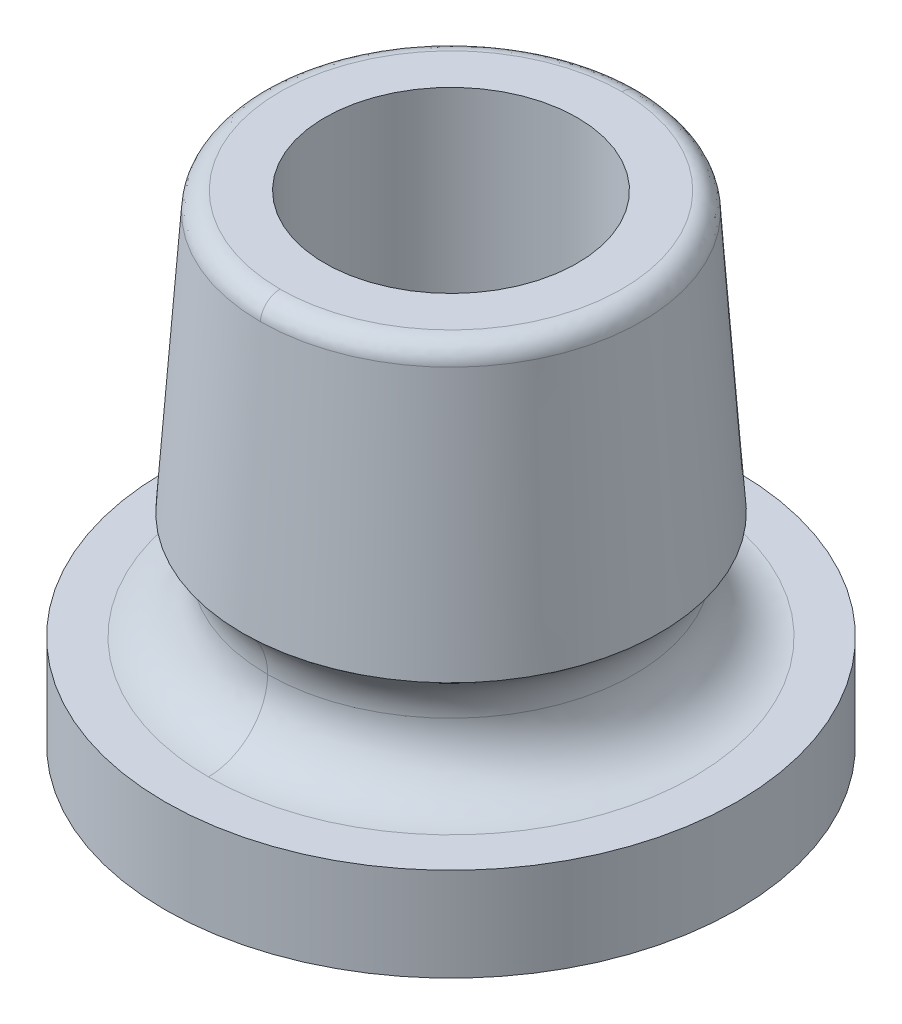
ISO-10303-21;
HEADER;
FILE_DESCRIPTION(('STEP AP214'),'2;1');
FILE_NAME('part.step','',(''),(''),'','','');
FILE_SCHEMA(('AUTOMOTIVE_DESIGN { 1 0 10303 214 1 1 1 1 }'));
ENDSEC;
DATA;
#1=APPLICATION_CONTEXT('core data for automotive mechanical design processes');
#2=APPLICATION_PROTOCOL_DEFINITION('international standard','automotive_design',2000,#1);
#3=PRODUCT_CONTEXT('',#1,'mechanical');
#4=PRODUCT('Part','Part','',(#3));
#5=PRODUCT_RELATED_PRODUCT_CATEGORY('part','',(#4));
#6=PRODUCT_DEFINITION_FORMATION('','',#4);
#7=PRODUCT_DEFINITION_CONTEXT('part definition',#1,'design');
#8=PRODUCT_DEFINITION('design','',#6,#7);
#9=PRODUCT_DEFINITION_SHAPE('','',#8);
#10=(LENGTH_UNIT() NAMED_UNIT(*) SI_UNIT(.MILLI.,.METRE.));
#11=(NAMED_UNIT(*) PLANE_ANGLE_UNIT() SI_UNIT($,.RADIAN.));
#12=(NAMED_UNIT(*) SI_UNIT($,.STERADIAN.) SOLID_ANGLE_UNIT());
#13=UNCERTAINTY_MEASURE_WITH_UNIT(LENGTH_MEASURE(1.E-05),#10,'distance_accuracy_value','');
#14=(GEOMETRIC_REPRESENTATION_CONTEXT(3) GLOBAL_UNCERTAINTY_ASSIGNED_CONTEXT((#13)) GLOBAL_UNIT_ASSIGNED_CONTEXT((#10,
#11,#12)) REPRESENTATION_CONTEXT('',''));
#15=CARTESIAN_POINT('',(0.,0.,0.));
#16=DIRECTION('',(0.,0.,1.));
#17=DIRECTION('',(1.,0.,0.));
#18=AXIS2_PLACEMENT_3D('',#15,#16,#17);
#19=CARTESIAN_POINT('',(0.,5.5873655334,-1.0880917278));
#20=CARTESIAN_POINT('',(-2.176183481,5.5873655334,-1.0880917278));
#21=CARTESIAN_POINT('',(-2.176183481,5.5873655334,1.0880917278));
#22=CARTESIAN_POINT('',(0.,5.5873655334,1.0880917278));
#23=CARTESIAN_POINT('',(0.,5.5955833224,-1.1699956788));
#24=CARTESIAN_POINT('',(-2.3399913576,5.5955833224,-1.1699956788));
#25=CARTESIAN_POINT('',(-2.3399913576,5.5955833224,1.1699956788));
#26=CARTESIAN_POINT('',(0.,5.5955833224,1.1699956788));
#27=CARTESIAN_POINT('',(0.,5.5394445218,-1.230197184));
#28=CARTESIAN_POINT('',(-2.460394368,5.5394445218,-1.230197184));
#29=CARTESIAN_POINT('',(-2.460394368,5.5394445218,1.230197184));
#30=CARTESIAN_POINT('',(0.,5.5394445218,1.230197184));
#31=CARTESIAN_POINT('',(0.,5.4571668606,-1.2277127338));
#32=CARTESIAN_POINT('',(-2.4554254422,5.4571668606,-1.2277127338));
#33=CARTESIAN_POINT('',(-2.4554254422,5.4571668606,1.2277127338));
#34=CARTESIAN_POINT('',(0.,5.4571668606,1.2277127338));
#35=(BOUNDED_SURFACE() B_SPLINE_SURFACE(3,3,((#19,#20,#21,#22),(#23,#24,#25,#26),(#27,#28,#29,
#30),(#31,#32,#33,#34)),.UNSPECIFIED.,.F.,.F.,.F.) B_SPLINE_SURFACE_WITH_KNOTS((4,4),(4,4),(0.,
1.),(0.,1.),.UNSPECIFIED.) GEOMETRIC_REPRESENTATION_ITEM() RATIONAL_B_SPLINE_SURFACE(((1.,
0.333333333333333,0.333333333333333,1.),(0.773075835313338,0.257691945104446,0.257691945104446,
0.773075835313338),(0.773075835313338,0.257691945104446,0.257691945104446,0.773075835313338),
(1.,0.333333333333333,0.333333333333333,1.))) REPRESENTATION_ITEM('') SURFACE());
#36=CARTESIAN_POINT('',(0.,5.5873655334,1.0880917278));
#37=CARTESIAN_POINT('',(0.,5.5955833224,1.1699956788));
#38=CARTESIAN_POINT('',(0.,5.5394445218,1.230197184));
#39=CARTESIAN_POINT('',(0.,5.4571668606,1.2277127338));
#40=(BOUNDED_CURVE() B_SPLINE_CURVE(3,(#36,#37,#38,#39),.UNSPECIFIED.,.F.,
.F.) B_SPLINE_CURVE_WITH_KNOTS((4,4),(0.,1.),
.UNSPECIFIED.) CURVE() GEOMETRIC_REPRESENTATION_ITEM() RATIONAL_B_SPLINE_CURVE((1.,
0.773075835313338,0.773075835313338,1.)) REPRESENTATION_ITEM(''));
#41=CARTESIAN_POINT('',(-2.51756514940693E-10,5.46985906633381,1.22746122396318));
#42=VERTEX_POINT('',#41);
#43=CARTESIAN_POINT('',(0.,5.58800000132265,1.10077058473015));
#44=VERTEX_POINT('',#43);
#45=EDGE_CURVE('E74',#42,#44,#40,.F.);
#46=CARTESIAN_POINT('',(0.,5.58800000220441,1.10077059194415));
#47=CARTESIAN_POINT('',(-2.20154120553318,5.58800000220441,1.10077059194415));
#48=CARTESIAN_POINT('',(-2.20154120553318,5.58800000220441,-1.10077059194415));
#49=CARTESIAN_POINT('',(0.,5.58800000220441,-1.10077059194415));
#50=(BOUNDED_CURVE() B_SPLINE_CURVE(3,(#46,#47,#48,#49),.UNSPECIFIED.,.F.,
.F.) B_SPLINE_CURVE_WITH_KNOTS((4,4),(0.,1.),
.UNSPECIFIED.) CURVE() GEOMETRIC_REPRESENTATION_ITEM() RATIONAL_B_SPLINE_CURVE((0.958564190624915,
0.319521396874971,0.319521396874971,0.958564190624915)) REPRESENTATION_ITEM(''));
#51=CARTESIAN_POINT('',(0.,5.58800000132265,-1.10077058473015));
#52=VERTEX_POINT('',#51);
#53=EDGE_CURVE('E69',#52,#44,#50,.F.);
#54=CARTESIAN_POINT('',(0.,5.5873655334,-1.0880917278));
#55=CARTESIAN_POINT('',(0.,5.5955833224,-1.1699956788));
#56=CARTESIAN_POINT('',(0.,5.5394445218,-1.230197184));
#57=CARTESIAN_POINT('',(0.,5.4571668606,-1.2277127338));
#58=(BOUNDED_CURVE() B_SPLINE_CURVE(3,(#54,#55,#56,#57),.UNSPECIFIED.,.F.,
.F.) B_SPLINE_CURVE_WITH_KNOTS((4,4),(0.,1.),
.UNSPECIFIED.) CURVE() GEOMETRIC_REPRESENTATION_ITEM() RATIONAL_B_SPLINE_CURVE((1.,
0.773075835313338,0.773075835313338,1.)) REPRESENTATION_ITEM(''));
#59=CARTESIAN_POINT('',(-1.102182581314E-10,5.46985906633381,-1.22746122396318));
#60=VERTEX_POINT('',#59);
#61=EDGE_CURVE('E64',#52,#60,#58,.T.);
#62=CARTESIAN_POINT('',(0.,5.46985906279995,0.));
#63=DIRECTION('',(0.,-1.,0.));
#64=DIRECTION('',(0.,0.,-1.));
#65=AXIS2_PLACEMENT_3D('',#62,#63,#64);
#66=CIRCLE('',#65,1.227461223);
#67=EDGE_CURVE('E67',#60,#42,#66,.F.);
#68=ORIENTED_EDGE('',*,*,#45,.T.);
#69=ORIENTED_EDGE('',*,*,#53,.F.);
#70=ORIENTED_EDGE('',*,*,#61,.T.);
#71=ORIENTED_EDGE('',*,*,#67,.T.);
#72=EDGE_LOOP('',(#68,#69,#70,#71));
#73=FACE_BOUND('',#72,.T.);
#74=ADVANCED_FACE('F16',(#73),#35,.T.);
#75=CARTESIAN_POINT('',(0.,5.588,0.));
#76=DIRECTION('',(0.,-1.,0.));
#77=DIRECTION('',(0.,0.,-1.));
#78=AXIS2_PLACEMENT_3D('',#75,#76,#77);
#79=CYLINDRICAL_SURFACE('',#78,0.8128);
#80=CARTESIAN_POINT('',(0.,2.4973137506,0.));
#81=DIRECTION('',(0.,-1.,0.));
#82=DIRECTION('',(0.,0.,-1.));
#83=AXIS2_PLACEMENT_3D('',#80,#81,#82);
#84=CIRCLE('',#83,0.8128);
#85=CARTESIAN_POINT('',(0.,2.4973137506,-0.8128));
#86=VERTEX_POINT('',#85);
#87=EDGE_CURVE('E151',#86,#86,#84,.F.);
#88=ORIENTED_EDGE('',*,*,#87,.F.);
#89=EDGE_LOOP('',(#88));
#90=FACE_BOUND('',#89,.T.);
#91=CARTESIAN_POINT('',(0.,5.588,0.));
#92=DIRECTION('',(0.,-1.,0.));
#93=DIRECTION('',(0.,0.,-1.));
#94=AXIS2_PLACEMENT_3D('',#91,#92,#93);
#95=CIRCLE('',#94,0.8128);
#96=CARTESIAN_POINT('',(0.,5.588,-0.8128));
#97=VERTEX_POINT('',#96);
#98=EDGE_CURVE('E21',#97,#97,#95,.T.);
#99=ORIENTED_EDGE('',*,*,#98,.F.);
#100=EDGE_LOOP('',(#99));
#101=FACE_BOUND('',#100,.T.);
#102=ADVANCED_FACE('F109',(#90,#101),#79,.F.);
#103=CARTESIAN_POINT('',(-1.1139798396,5.588,-1.1139798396));
#104=DIRECTION('',(0.,1.,0.));
#105=DIRECTION('',(0.,0.,1.));
#106=AXIS2_PLACEMENT_3D('',#103,#104,#105);
#107=PLANE('',#106);
#108=ORIENTED_EDGE('',*,*,#98,.T.);
#109=EDGE_LOOP('',(#108));
#110=FACE_BOUND('',#109,.T.);
#111=CARTESIAN_POINT('',(0.,5.58800000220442,-1.10077057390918));
#112=CARTESIAN_POINT('',(2.20154116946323,5.58800000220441,-1.10077057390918));
#113=CARTESIAN_POINT('',(2.20154116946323,5.58800000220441,1.10077057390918));
#114=CARTESIAN_POINT('',(0.,5.58800000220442,1.10077057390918));
#115=(BOUNDED_CURVE() B_SPLINE_CURVE(3,(#111,#112,#113,#114),.UNSPECIFIED.,.F.,
.F.) B_SPLINE_CURVE_WITH_KNOTS((4,4),(0.,1.),
.UNSPECIFIED.) CURVE() GEOMETRIC_REPRESENTATION_ITEM() RATIONAL_B_SPLINE_CURVE((0.958564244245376,
0.319521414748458,0.319521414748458,0.958564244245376)) REPRESENTATION_ITEM(''));
#116=EDGE_CURVE('E93',#52,#44,#115,.T.);
#117=ORIENTED_EDGE('',*,*,#116,.F.);
#118=ORIENTED_EDGE('',*,*,#53,.T.);
#119=EDGE_LOOP('',(#117,#118));
#120=FACE_BOUND('',#119,.T.);
#121=ADVANCED_FACE('F99',(#110,#120),#107,.T.);
#122=CARTESIAN_POINT('',(-1.863598,2.4973137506,1.863598));
#123=DIRECTION('',(0.,-1.,0.));
#124=DIRECTION('',(0.,0.,-1.));
#125=AXIS2_PLACEMENT_3D('',#122,#123,#124);
#126=PLANE('',#125);
#127=ORIENTED_EDGE('',*,*,#87,.T.);
#128=EDGE_LOOP('',(#127));
#129=FACE_BOUND('',#128,.T.);
#130=CARTESIAN_POINT('',(0.,2.4973137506,0.));
#131=DIRECTION('',(0.,-1.,0.));
#132=DIRECTION('',(1.,0.,0.));
#133=AXIS2_PLACEMENT_3D('',#130,#131,#132);
#134=CIRCLE('',#133,1.8415);
#135=CARTESIAN_POINT('',(1.8415,2.4973137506,0.));
#136=VERTEX_POINT('',#135);
#137=EDGE_CURVE('E148',#136,#136,#134,.T.);
#138=ORIENTED_EDGE('',*,*,#137,.T.);
#139=EDGE_LOOP('',(#138));
#140=FACE_BOUND('',#139,.T.);
#141=ADVANCED_FACE('F108',(#129,#140),#126,.T.);
#142=CARTESIAN_POINT('',(0.,3.8128504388,1.377063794));
#143=CARTESIAN_POINT('',(-2.754127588,3.8128504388,1.377063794));
#144=CARTESIAN_POINT('',(-2.754127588,3.8128504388,-1.377063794));
#145=CARTESIAN_POINT('',(0.,3.8128504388,-1.377063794));
#146=CARTESIAN_POINT('',(0.,3.7367048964,1.2400078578));
#147=CARTESIAN_POINT('',(-2.4800157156,3.73670489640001,1.2400078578));
#148=CARTESIAN_POINT('',(-2.4800157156,3.73670489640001,-1.2400078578));
#149=CARTESIAN_POINT('',(0.,3.7367048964,-1.2400078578));
#150=CARTESIAN_POINT('',(0.,3.5977681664,1.167350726));
#151=CARTESIAN_POINT('',(-2.3347014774,3.5977681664,1.167350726));
#152=CARTESIAN_POINT('',(-2.3347014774,3.5977681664,-1.167350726));
#153=CARTESIAN_POINT('',(0.,3.5977681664,-1.167350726));
#154=CARTESIAN_POINT('',(0.,3.4417634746,1.1830034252));
#155=CARTESIAN_POINT('',(-2.366006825,3.4417634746,1.1830034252));
#156=CARTESIAN_POINT('',(-2.366006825,3.4417634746,-1.1830034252));
#157=CARTESIAN_POINT('',(0.,3.4417634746,-1.1830034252));
#158=(BOUNDED_SURFACE() B_SPLINE_SURFACE(3,3,((#142,#143,#144,#145),(#146,#147,#148,#149),(#150,
#151,#152,#153),(#154,#155,#156,#157)),.UNSPECIFIED.,.F.,.F.,
.F.) B_SPLINE_SURFACE_WITH_KNOTS((4,4),(4,4),(0.,1.),(0.,1.),
.UNSPECIFIED.) GEOMETRIC_REPRESENTATION_ITEM() RATIONAL_B_SPLINE_SURFACE(((1.,0.333333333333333,
0.333333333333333,1.),(0.89030208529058,0.296767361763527,0.296767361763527,0.89030208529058),
(0.89030208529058,0.296767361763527,0.296767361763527,0.89030208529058),(1.,0.333333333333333,
0.333333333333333,1.))) REPRESENTATION_ITEM('') SURFACE());
#159=CARTESIAN_POINT('',(0.,3.8128504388,1.377063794));
#160=CARTESIAN_POINT('',(0.,3.7367048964,1.2400078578));
#161=CARTESIAN_POINT('',(0.,3.5977681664,1.167350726));
#162=CARTESIAN_POINT('',(0.,3.4417634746,1.1830034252));
#163=(BOUNDED_CURVE() B_SPLINE_CURVE(3,(#159,#160,#161,#162),.UNSPECIFIED.,.F.,
.F.) B_SPLINE_CURVE_WITH_KNOTS((4,4),(0.,1.),
.UNSPECIFIED.) CURVE() GEOMETRIC_REPRESENTATION_ITEM() RATIONAL_B_SPLINE_CURVE((1.,
0.89030208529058,0.89030208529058,1.)) REPRESENTATION_ITEM(''));
#164=CARTESIAN_POINT('',(-1.37905312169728E-10,3.79271378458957,1.34473863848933));
#165=VERTEX_POINT('',#164);
#166=CARTESIAN_POINT('',(0.,3.47979999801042,1.18110001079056));
#167=VERTEX_POINT('',#166);
#168=EDGE_CURVE('E255',#165,#167,#163,.T.);
#169=CARTESIAN_POINT('',(0.,3.79271377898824,0.));
#170=DIRECTION('',(0.,1.,0.));
#171=DIRECTION('',(-1.,0.,0.));
#172=AXIS2_PLACEMENT_3D('',#169,#170,#171);
#173=CIRCLE('',#172,1.34473863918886);
#174=CARTESIAN_POINT('',(-6.03744484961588E-11,3.79271377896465,-1.34473863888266));
#175=VERTEX_POINT('',#174);
#176=EDGE_CURVE('E157',#175,#165,#173,.T.);
#177=CARTESIAN_POINT('',(0.,3.8128504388,-1.377063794));
#178=CARTESIAN_POINT('',(0.,3.7367048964,-1.2400078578));
#179=CARTESIAN_POINT('',(0.,3.5977681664,-1.167350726));
#180=CARTESIAN_POINT('',(0.,3.4417634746,-1.1830034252));
#181=(BOUNDED_CURVE() B_SPLINE_CURVE(3,(#177,#178,#179,#180),.UNSPECIFIED.,.F.,
.F.) B_SPLINE_CURVE_WITH_KNOTS((4,4),(0.,1.),
.UNSPECIFIED.) CURVE() GEOMETRIC_REPRESENTATION_ITEM() RATIONAL_B_SPLINE_CURVE((1.,
0.89030208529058,0.89030208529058,1.)) REPRESENTATION_ITEM(''));
#182=CARTESIAN_POINT('',(0.,3.47979999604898,-1.18110001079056));
#183=VERTEX_POINT('',#182);
#184=EDGE_CURVE('E153',#183,#175,#181,.F.);
#185=CARTESIAN_POINT('',(0.,3.47979999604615,0.));
#186=DIRECTION('',(0.,1.,0.));
#187=DIRECTION('',(-1.,0.,0.));
#188=AXIS2_PLACEMENT_3D('',#185,#186,#187);
#189=CIRCLE('',#188,1.18110001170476);
#190=EDGE_CURVE('E298',#183,#167,#189,.T.);
#191=ORIENTED_EDGE('',*,*,#168,.F.);
#192=ORIENTED_EDGE('',*,*,#176,.F.);
#193=ORIENTED_EDGE('',*,*,#184,.F.);
#194=ORIENTED_EDGE('',*,*,#190,.T.);
#195=EDGE_LOOP('',(#191,#192,#193,#194));
#196=FACE_BOUND('',#195,.T.);
#197=ADVANCED_FACE('F230',(#196),#158,.F.);
#198=CARTESIAN_POINT('',(0.,5.5873655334,1.0880917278));
#199=CARTESIAN_POINT('',(2.176183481,5.5873655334,1.0880917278));
#200=CARTESIAN_POINT('',(2.176183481,5.5873655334,-1.0880917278));
#201=CARTESIAN_POINT('',(0.,5.5873655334,-1.0880917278));
#202=CARTESIAN_POINT('',(0.,5.5955833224,1.1699956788));
#203=CARTESIAN_POINT('',(2.3399913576,5.5955833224,1.1699956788));
#204=CARTESIAN_POINT('',(2.3399913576,5.5955833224,-1.1699956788));
#205=CARTESIAN_POINT('',(0.,5.5955833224,-1.1699956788));
#206=CARTESIAN_POINT('',(0.,5.5394445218,1.230197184));
#207=CARTESIAN_POINT('',(2.460394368,5.5394445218,1.230197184));
#208=CARTESIAN_POINT('',(2.460394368,5.5394445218,-1.230197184));
#209=CARTESIAN_POINT('',(0.,5.5394445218,-1.230197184));
#210=CARTESIAN_POINT('',(0.,5.4571668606,1.2277127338));
#211=CARTESIAN_POINT('',(2.4554254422,5.4571668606,1.2277127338));
#212=CARTESIAN_POINT('',(2.4554254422,5.4571668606,-1.2277127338));
#213=CARTESIAN_POINT('',(0.,5.4571668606,-1.2277127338));
#214=(BOUNDED_SURFACE() B_SPLINE_SURFACE(3,3,((#198,#199,#200,#201),(#202,#203,#204,#205),(#206,
#207,#208,#209),(#210,#211,#212,#213)),.UNSPECIFIED.,.F.,.F.,
.F.) B_SPLINE_SURFACE_WITH_KNOTS((4,4),(4,4),(0.,1.),(0.,1.),
.UNSPECIFIED.) GEOMETRIC_REPRESENTATION_ITEM() RATIONAL_B_SPLINE_SURFACE(((1.,0.333333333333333,
0.333333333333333,1.),(0.773075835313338,0.257691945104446,0.257691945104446,0.773075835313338),
(0.773075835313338,0.257691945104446,0.257691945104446,0.773075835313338),(1.,0.333333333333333,
0.333333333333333,1.))) REPRESENTATION_ITEM('') SURFACE());
#215=CARTESIAN_POINT('',(0.,5.46985906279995,0.));
#216=DIRECTION('',(0.,-1.,0.));
#217=DIRECTION('',(0.,0.,-1.));
#218=AXIS2_PLACEMENT_3D('',#215,#216,#217);
#219=CIRCLE('',#218,1.227461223);
#220=EDGE_CURVE('E77',#42,#60,#219,.F.);
#221=ORIENTED_EDGE('',*,*,#116,.T.);
#222=ORIENTED_EDGE('',*,*,#45,.F.);
#223=ORIENTED_EDGE('',*,*,#220,.T.);
#224=ORIENTED_EDGE('',*,*,#61,.F.);
#225=EDGE_LOOP('',(#221,#222,#223,#224));
#226=FACE_BOUND('',#225,.T.);
#227=ADVANCED_FACE('F78',(#226),#214,.T.);
#228=CARTESIAN_POINT('',(0.,3.0988,0.));
#229=DIRECTION('',(0.,-1.,0.));
#230=DIRECTION('',(1.,0.,0.));
#231=AXIS2_PLACEMENT_3D('',#228,#229,#230);
#232=CYLINDRICAL_SURFACE('',#231,1.8415);
#233=CARTESIAN_POINT('',(0.,3.0988,0.));
#234=DIRECTION('',(0.,-1.,0.));
#235=DIRECTION('',(1.,0.,0.));
#236=AXIS2_PLACEMENT_3D('',#233,#234,#235);
#237=CIRCLE('',#236,1.8415);
#238=CARTESIAN_POINT('',(1.8415,3.0988,0.));
#239=VERTEX_POINT('',#238);
#240=EDGE_CURVE('E80',#239,#239,#237,.F.);
#241=ORIENTED_EDGE('',*,*,#240,.F.);
#242=EDGE_LOOP('',(#241));
#243=FACE_BOUND('',#242,.T.);
#244=ORIENTED_EDGE('',*,*,#137,.F.);
#245=EDGE_LOOP('',(#244));
#246=FACE_BOUND('',#245,.T.);
#247=ADVANCED_FACE('F217',(#243,#246),#232,.T.);
#248=CARTESIAN_POINT('',(0.,3.5178365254,1.1830034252));
#249=CARTESIAN_POINT('',(-2.366006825,3.51783652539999,1.1830034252));
#250=CARTESIAN_POINT('',(-2.366006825,3.51783652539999,-1.1830034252));
#251=CARTESIAN_POINT('',(0.,3.5178365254,-1.1830034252));
#252=CARTESIAN_POINT('',(0.,3.2587995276,1.1570130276));
#253=CARTESIAN_POINT('',(-2.3140260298,3.2587995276,1.1570130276));
#254=CARTESIAN_POINT('',(-2.3140260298,3.2587995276,-1.1570130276));
#255=CARTESIAN_POINT('',(0.,3.2587995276,-1.1570130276));
#256=CARTESIAN_POINT('',(0.,3.0747130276,1.3410995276));
#257=CARTESIAN_POINT('',(-2.6821990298,3.0747130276,1.3410995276));
#258=CARTESIAN_POINT('',(-2.6821990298,3.0747130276,-1.3410995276));
#259=CARTESIAN_POINT('',(0.,3.0747130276,-1.3410995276));
#260=CARTESIAN_POINT('',(0.,3.1007034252,1.6001365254));
#261=CARTESIAN_POINT('',(-3.2002730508,3.1007034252,1.6001365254));
#262=CARTESIAN_POINT('',(-3.2002730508,3.1007034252,-1.6001365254));
#263=CARTESIAN_POINT('',(0.,3.1007034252,-1.6001365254));
#264=(BOUNDED_SURFACE() B_SPLINE_SURFACE(3,3,((#248,#249,#250,#251),(#252,#253,#254,#255),(#256,
#257,#258,#259),(#260,#261,#262,#263)),.UNSPECIFIED.,.F.,.F.,
.F.) B_SPLINE_SURFACE_WITH_KNOTS((4,4),(4,4),(0.,1.),(0.,1.),
.UNSPECIFIED.) GEOMETRIC_REPRESENTATION_ITEM() RATIONAL_B_SPLINE_SURFACE(((1.,0.333333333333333,
0.333333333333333,1.),(0.755320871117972,0.251773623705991,0.251773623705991,0.755320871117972),
(0.755320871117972,0.251773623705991,0.251773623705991,0.755320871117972),(1.,0.333333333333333,
0.333333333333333,1.))) REPRESENTATION_ITEM('') SURFACE());
#265=CARTESIAN_POINT('',(0.,3.5178365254,-1.1830034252));
#266=CARTESIAN_POINT('',(0.,3.2587995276,-1.1570130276));
#267=CARTESIAN_POINT('',(0.,3.0747130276,-1.3410995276));
#268=CARTESIAN_POINT('',(0.,3.1007034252,-1.6001365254));
#269=(BOUNDED_CURVE() B_SPLINE_CURVE(3,(#265,#266,#267,#268),.UNSPECIFIED.,.F.,
.F.) B_SPLINE_CURVE_WITH_KNOTS((4,4),(0.,1.),
.UNSPECIFIED.) CURVE() GEOMETRIC_REPRESENTATION_ITEM() RATIONAL_B_SPLINE_CURVE((1.,
0.755320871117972,0.755320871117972,1.)) REPRESENTATION_ITEM(''));
#270=CARTESIAN_POINT('',(0.,3.09880000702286,-1.56209999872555));
#271=VERTEX_POINT('',#270);
#272=EDGE_CURVE('E150',#271,#183,#269,.F.);
#273=CARTESIAN_POINT('',(0.,3.09880001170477,-1.56209999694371));
#274=CARTESIAN_POINT('',(-3.12419999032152,3.09880001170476,-1.56209999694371));
#275=CARTESIAN_POINT('',(-3.12419999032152,3.09880001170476,1.56209999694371));
#276=CARTESIAN_POINT('',(0.,3.09880001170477,1.56209999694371));
#277=(BOUNDED_CURVE() B_SPLINE_CURVE(3,(#273,#274,#275,#276),.UNSPECIFIED.,.F.,
.F.) B_SPLINE_CURVE_WITH_KNOTS((4,4),(0.,1.),
.UNSPECIFIED.) CURVE() GEOMETRIC_REPRESENTATION_ITEM() RATIONAL_B_SPLINE_CURVE((0.956578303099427,
0.318859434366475,0.318859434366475,0.956578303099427)) REPRESENTATION_ITEM(''));
#278=CARTESIAN_POINT('',(0.,3.09880000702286,1.56209999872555));
#279=VERTEX_POINT('',#278);
#280=EDGE_CURVE('E137',#279,#271,#277,.F.);
#281=CARTESIAN_POINT('',(0.,3.5178365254,1.1830034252));
#282=CARTESIAN_POINT('',(0.,3.2587995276,1.1570130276));
#283=CARTESIAN_POINT('',(0.,3.0747130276,1.3410995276));
#284=CARTESIAN_POINT('',(0.,3.1007034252,1.6001365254));
#285=(BOUNDED_CURVE() B_SPLINE_CURVE(3,(#281,#282,#283,#284),.UNSPECIFIED.,.F.,
.F.) B_SPLINE_CURVE_WITH_KNOTS((4,4),(0.,1.),
.UNSPECIFIED.) CURVE() GEOMETRIC_REPRESENTATION_ITEM() RATIONAL_B_SPLINE_CURVE((1.,
0.755320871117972,0.755320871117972,1.)) REPRESENTATION_ITEM(''));
#286=EDGE_CURVE('E36',#167,#279,#285,.T.);
#287=ORIENTED_EDGE('',*,*,#190,.F.);
#288=ORIENTED_EDGE('',*,*,#272,.F.);
#289=ORIENTED_EDGE('',*,*,#280,.F.);
#290=ORIENTED_EDGE('',*,*,#286,.F.);
#291=EDGE_LOOP('',(#287,#288,#289,#290));
#292=FACE_BOUND('',#291,.T.);
#293=ADVANCED_FACE('F206',(#292),#264,.F.);
#294=CARTESIAN_POINT('',(0.,5.4698590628,0.));
#295=DIRECTION('',(0.,-1.,0.));
#296=DIRECTION('',(0.,0.,-1.));
#297=AXIS2_PLACEMENT_3D('',#294,#295,#296);
#298=CONICAL_SURFACE('',#297,1.227461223,0.0698131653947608);
#299=ORIENTED_EDGE('',*,*,#67,.F.);
#300=ORIENTED_EDGE('',*,*,#220,.F.);
#301=EDGE_LOOP('',(#299,#300));
#302=FACE_BOUND('',#301,.T.);
#303=CARTESIAN_POINT('',(0.,3.79271377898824,0.));
#304=DIRECTION('',(0.,1.,0.));
#305=DIRECTION('',(-1.,0.,0.));
#306=AXIS2_PLACEMENT_3D('',#303,#304,#305);
#307=CIRCLE('',#306,1.34473863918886);
#308=EDGE_CURVE('E244',#165,#175,#307,.T.);
#309=ORIENTED_EDGE('',*,*,#308,.T.);
#310=ORIENTED_EDGE('',*,*,#176,.T.);
#311=EDGE_LOOP('',(#309,#310));
#312=FACE_BOUND('',#311,.T.);
#313=ADVANCED_FACE('F82',(#302,#312),#298,.T.);
#314=CARTESIAN_POINT('',(-1.863598,3.0988,-1.863598));
#315=DIRECTION('',(0.,1.,0.));
#316=DIRECTION('',(0.,0.,1.));
#317=AXIS2_PLACEMENT_3D('',#314,#315,#316);
#318=PLANE('',#317);
#319=CARTESIAN_POINT('',(0.,3.09880001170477,1.56209999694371));
#320=CARTESIAN_POINT('',(3.12419999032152,3.09880001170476,1.56209999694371));
#321=CARTESIAN_POINT('',(3.12419999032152,3.09880001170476,-1.56209999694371));
#322=CARTESIAN_POINT('',(0.,3.09880001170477,-1.56209999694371));
#323=(BOUNDED_CURVE() B_SPLINE_CURVE(3,(#319,#320,#321,#322),.UNSPECIFIED.,.F.,
.F.) B_SPLINE_CURVE_WITH_KNOTS((4,4),(0.,1.),
.UNSPECIFIED.) CURVE() GEOMETRIC_REPRESENTATION_ITEM() RATIONAL_B_SPLINE_CURVE((0.956578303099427,
0.318859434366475,0.318859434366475,0.956578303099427)) REPRESENTATION_ITEM(''));
#324=EDGE_CURVE('E27',#271,#279,#323,.F.);
#325=ORIENTED_EDGE('',*,*,#324,.T.);
#326=ORIENTED_EDGE('',*,*,#280,.T.);
#327=EDGE_LOOP('',(#325,#326));
#328=FACE_BOUND('',#327,.T.);
#329=ORIENTED_EDGE('',*,*,#240,.T.);
#330=EDGE_LOOP('',(#329));
#331=FACE_BOUND('',#330,.T.);
#332=ADVANCED_FACE('F18',(#328,#331),#318,.T.);
#333=CARTESIAN_POINT('',(0.,3.8128504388,-1.377063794));
#334=CARTESIAN_POINT('',(2.754127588,3.8128504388,-1.377063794));
#335=CARTESIAN_POINT('',(2.754127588,3.8128504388,1.377063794));
#336=CARTESIAN_POINT('',(0.,3.8128504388,1.377063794));
#337=CARTESIAN_POINT('',(0.,3.7367048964,-1.2400078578));
#338=CARTESIAN_POINT('',(2.4800157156,3.73670489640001,-1.2400078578));
#339=CARTESIAN_POINT('',(2.4800157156,3.73670489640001,1.2400078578));
#340=CARTESIAN_POINT('',(0.,3.7367048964,1.2400078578));
#341=CARTESIAN_POINT('',(0.,3.5977681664,-1.167350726));
#342=CARTESIAN_POINT('',(2.3347014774,3.5977681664,-1.167350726));
#343=CARTESIAN_POINT('',(2.3347014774,3.5977681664,1.167350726));
#344=CARTESIAN_POINT('',(0.,3.5977681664,1.167350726));
#345=CARTESIAN_POINT('',(0.,3.4417634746,-1.1830034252));
#346=CARTESIAN_POINT('',(2.366006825,3.4417634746,-1.1830034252));
#347=CARTESIAN_POINT('',(2.366006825,3.4417634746,1.1830034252));
#348=CARTESIAN_POINT('',(0.,3.4417634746,1.1830034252));
#349=(BOUNDED_SURFACE() B_SPLINE_SURFACE(3,3,((#333,#334,#335,#336),(#337,#338,#339,#340),(#341,
#342,#343,#344),(#345,#346,#347,#348)),.UNSPECIFIED.,.F.,.F.,
.F.) B_SPLINE_SURFACE_WITH_KNOTS((4,4),(4,4),(0.,1.),(0.,1.),
.UNSPECIFIED.) GEOMETRIC_REPRESENTATION_ITEM() RATIONAL_B_SPLINE_SURFACE(((1.,0.333333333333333,
0.333333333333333,1.),(0.89030208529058,0.296767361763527,0.296767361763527,0.89030208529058),
(0.89030208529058,0.296767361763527,0.296767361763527,0.89030208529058),(1.,0.333333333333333,
0.333333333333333,1.))) REPRESENTATION_ITEM('') SURFACE());
#350=CARTESIAN_POINT('',(0.,3.47979999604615,0.));
#351=DIRECTION('',(0.,1.,0.));
#352=DIRECTION('',(-1.,0.,0.));
#353=AXIS2_PLACEMENT_3D('',#350,#351,#352);
#354=CIRCLE('',#353,1.18110001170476);
#355=EDGE_CURVE('E11',#167,#183,#354,.T.);
#356=ORIENTED_EDGE('',*,*,#184,.T.);
#357=ORIENTED_EDGE('',*,*,#308,.F.);
#358=ORIENTED_EDGE('',*,*,#168,.T.);
#359=ORIENTED_EDGE('',*,*,#355,.T.);
#360=EDGE_LOOP('',(#356,#357,#358,#359));
#361=FACE_BOUND('',#360,.T.);
#362=ADVANCED_FACE('F171',(#361),#349,.F.);
#363=CARTESIAN_POINT('',(0.,3.5178365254,-1.1830034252));
#364=CARTESIAN_POINT('',(2.366006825,3.51783652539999,-1.1830034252));
#365=CARTESIAN_POINT('',(2.366006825,3.51783652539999,1.1830034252));
#366=CARTESIAN_POINT('',(0.,3.5178365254,1.1830034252));
#367=CARTESIAN_POINT('',(0.,3.2587995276,-1.1570130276));
#368=CARTESIAN_POINT('',(2.3140260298,3.2587995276,-1.1570130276));
#369=CARTESIAN_POINT('',(2.3140260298,3.2587995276,1.1570130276));
#370=CARTESIAN_POINT('',(0.,3.2587995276,1.1570130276));
#371=CARTESIAN_POINT('',(0.,3.0747130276,-1.3410995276));
#372=CARTESIAN_POINT('',(2.6821990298,3.0747130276,-1.3410995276));
#373=CARTESIAN_POINT('',(2.6821990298,3.0747130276,1.3410995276));
#374=CARTESIAN_POINT('',(0.,3.0747130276,1.3410995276));
#375=CARTESIAN_POINT('',(0.,3.1007034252,-1.6001365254));
#376=CARTESIAN_POINT('',(3.2002730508,3.1007034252,-1.6001365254));
#377=CARTESIAN_POINT('',(3.2002730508,3.1007034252,1.6001365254));
#378=CARTESIAN_POINT('',(0.,3.1007034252,1.6001365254));
#379=(BOUNDED_SURFACE() B_SPLINE_SURFACE(3,3,((#363,#364,#365,#366),(#367,#368,#369,#370),(#371,
#372,#373,#374),(#375,#376,#377,#378)),.UNSPECIFIED.,.F.,.F.,
.F.) B_SPLINE_SURFACE_WITH_KNOTS((4,4),(4,4),(0.,1.),(0.,1.),
.UNSPECIFIED.) GEOMETRIC_REPRESENTATION_ITEM() RATIONAL_B_SPLINE_SURFACE(((1.,0.333333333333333,
0.333333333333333,1.),(0.755320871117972,0.251773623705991,0.251773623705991,0.755320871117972),
(0.755320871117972,0.251773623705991,0.251773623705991,0.755320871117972),(1.,0.333333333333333,
0.333333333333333,1.))) REPRESENTATION_ITEM('') SURFACE());
#380=ORIENTED_EDGE('',*,*,#355,.F.);
#381=ORIENTED_EDGE('',*,*,#286,.T.);
#382=ORIENTED_EDGE('',*,*,#324,.F.);
#383=ORIENTED_EDGE('',*,*,#272,.T.);
#384=EDGE_LOOP('',(#380,#381,#382,#383));
#385=FACE_BOUND('',#384,.T.);
#386=ADVANCED_FACE('F169',(#385),#379,.F.);
#387=CLOSED_SHELL('',(#74,#102,#121,#141,#197,#227,#247,#293,#313,#332,#362,#386));
#388=MANIFOLD_SOLID_BREP('B1',#387);
#389=ADVANCED_BREP_SHAPE_REPRESENTATION('',(#18,#388),#14);
#390=SHAPE_DEFINITION_REPRESENTATION(#9,#389);
ENDSEC;
END-ISO-10303-21;
